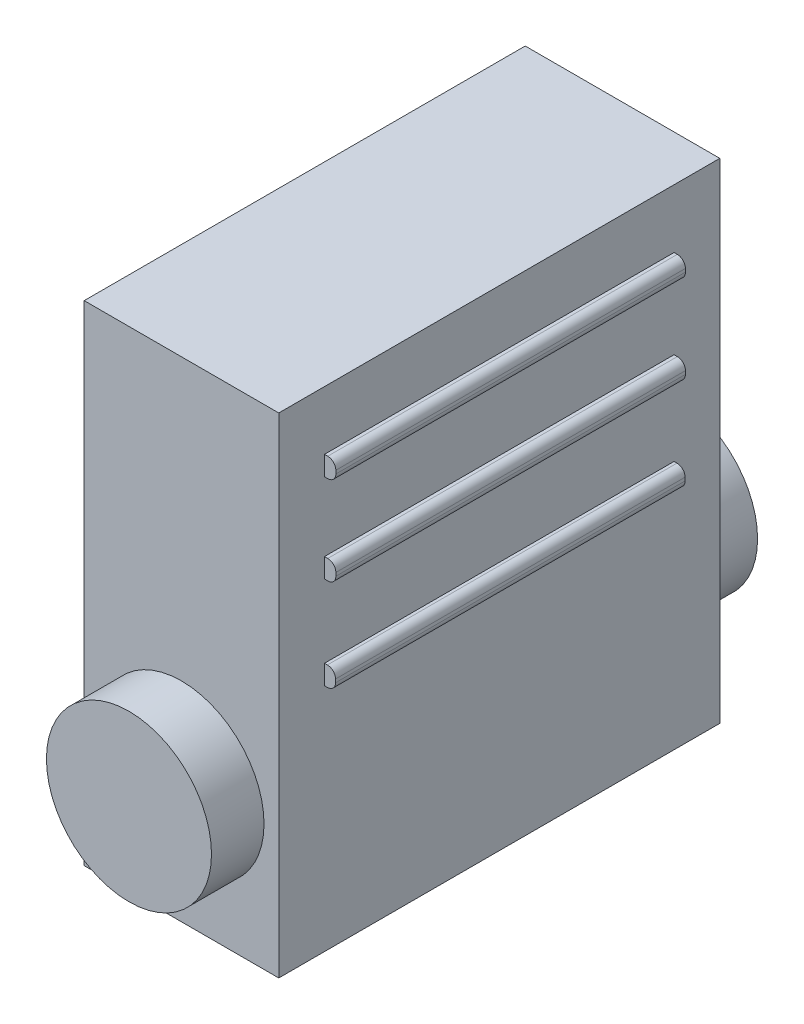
ISO-10303-21;
HEADER;
FILE_DESCRIPTION(('STEP AP214'),'2;1');
FILE_NAME('part.step','',(''),(''),'','','');
FILE_SCHEMA(('AUTOMOTIVE_DESIGN { 1 0 10303 214 1 1 1 1 }'));
ENDSEC;
DATA;
#1=APPLICATION_CONTEXT('core data for automotive mechanical design processes');
#2=APPLICATION_PROTOCOL_DEFINITION('international standard','automotive_design',2000,#1);
#3=PRODUCT_CONTEXT('',#1,'mechanical');
#4=PRODUCT('Part','Part','',(#3));
#5=PRODUCT_RELATED_PRODUCT_CATEGORY('part','',(#4));
#6=PRODUCT_DEFINITION_FORMATION('','',#4);
#7=PRODUCT_DEFINITION_CONTEXT('part definition',#1,'design');
#8=PRODUCT_DEFINITION('design','',#6,#7);
#9=PRODUCT_DEFINITION_SHAPE('','',#8);
#10=(LENGTH_UNIT() NAMED_UNIT(*) SI_UNIT(.MILLI.,.METRE.));
#11=(NAMED_UNIT(*) PLANE_ANGLE_UNIT() SI_UNIT($,.RADIAN.));
#12=(NAMED_UNIT(*) SI_UNIT($,.STERADIAN.) SOLID_ANGLE_UNIT());
#13=UNCERTAINTY_MEASURE_WITH_UNIT(LENGTH_MEASURE(1.E-05),#10,'distance_accuracy_value','');
#14=(GEOMETRIC_REPRESENTATION_CONTEXT(3) GLOBAL_UNCERTAINTY_ASSIGNED_CONTEXT((#13)) GLOBAL_UNIT_ASSIGNED_CONTEXT((#10,
#11,#12)) REPRESENTATION_CONTEXT('',''));
#15=CARTESIAN_POINT('',(0.,0.,0.));
#16=DIRECTION('',(0.,0.,1.));
#17=DIRECTION('',(1.,0.,0.));
#18=AXIS2_PLACEMENT_3D('',#15,#16,#17);
#19=CARTESIAN_POINT('',(-7.62,19.1643,34.544));
#20=DIRECTION('',(1.,0.,0.));
#21=DIRECTION('',(0.,1.,0.));
#22=AXIS2_PLACEMENT_3D('',#19,#20,#21);
#23=PLANE('',#22);
#24=DIRECTION('',(0.,1.,0.));
#25=VECTOR('',#24,1.);
#26=CARTESIAN_POINT('',(-7.62,0.39370000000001,30.9626));
#27=LINE('',#26,#25);
#28=CARTESIAN_POINT('',(-7.62,-1.13029999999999,30.9626));
#29=VERTEX_POINT('',#28);
#30=CARTESIAN_POINT('',(-7.62,0.393700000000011,30.9626));
#31=VERTEX_POINT('',#30);
#32=EDGE_CURVE('E286',#29,#31,#27,.T.);
#33=ORIENTED_EDGE('',*,*,#32,.F.);
#34=DIRECTION('',(0.,0.,1.));
#35=VECTOR('',#34,1.);
#36=CARTESIAN_POINT('',(-7.62,-1.13029999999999,3.5814));
#37=LINE('',#36,#35);
#38=CARTESIAN_POINT('',(-7.62,-1.13029999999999,3.5814));
#39=VERTEX_POINT('',#38);
#40=EDGE_CURVE('E291',#39,#29,#37,.T.);
#41=ORIENTED_EDGE('',*,*,#40,.F.);
#42=DIRECTION('',(0.,-1.,0.));
#43=VECTOR('',#42,1.);
#44=CARTESIAN_POINT('',(-7.62,0.39370000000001,3.5814));
#45=LINE('',#44,#43);
#46=CARTESIAN_POINT('',(-7.62,0.393700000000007,3.5814));
#47=VERTEX_POINT('',#46);
#48=EDGE_CURVE('E300',#47,#39,#45,.T.);
#49=ORIENTED_EDGE('',*,*,#48,.F.);
#50=DIRECTION('',(0.,0.,-1.));
#51=VECTOR('',#50,1.);
#52=CARTESIAN_POINT('',(-7.62,0.39370000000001,3.5814));
#53=LINE('',#52,#51);
#54=EDGE_CURVE('E297',#31,#47,#53,.T.);
#55=ORIENTED_EDGE('',*,*,#54,.F.);
#56=EDGE_LOOP('',(#33,#41,#49,#55));
#57=FACE_BOUND('',#56,.T.);
#58=DIRECTION('',(0.,-1.,0.));
#59=VECTOR('',#58,1.);
#60=CARTESIAN_POINT('',(-7.62,19.1643,0.));
#61=LINE('',#60,#59);
#62=CARTESIAN_POINT('',(-7.62,19.1643,0.));
#63=VERTEX_POINT('',#62);
#64=CARTESIAN_POINT('',(-7.62,-19.1643,0.));
#65=VERTEX_POINT('',#64);
#66=EDGE_CURVE('E414',#63,#65,#61,.T.);
#67=ORIENTED_EDGE('',*,*,#66,.T.);
#68=DIRECTION('',(0.,0.,-1.));
#69=VECTOR('',#68,1.);
#70=CARTESIAN_POINT('',(-7.62,-19.1643,34.544));
#71=LINE('',#70,#69);
#72=CARTESIAN_POINT('',(-7.62,-19.1643,34.544));
#73=VERTEX_POINT('',#72);
#74=EDGE_CURVE('E419',#73,#65,#71,.T.);
#75=ORIENTED_EDGE('',*,*,#74,.F.);
#76=DIRECTION('',(0.,-1.,0.));
#77=VECTOR('',#76,1.);
#78=CARTESIAN_POINT('',(-7.62,19.1643,34.544));
#79=LINE('',#78,#77);
#80=CARTESIAN_POINT('',(-7.62,19.1643,34.544));
#81=VERTEX_POINT('',#80);
#82=EDGE_CURVE('E405',#81,#73,#79,.T.);
#83=ORIENTED_EDGE('',*,*,#82,.F.);
#84=DIRECTION('',(0.,0.,-1.));
#85=VECTOR('',#84,1.);
#86=CARTESIAN_POINT('',(-7.62,19.1643,34.544));
#87=LINE('',#86,#85);
#88=EDGE_CURVE('E422',#81,#63,#87,.T.);
#89=ORIENTED_EDGE('',*,*,#88,.T.);
#90=EDGE_LOOP('',(#67,#75,#83,#89));
#91=FACE_BOUND('',#90,.T.);
#92=DIRECTION('',(0.,1.,0.));
#93=VECTOR('',#92,1.);
#94=CARTESIAN_POINT('',(-7.62,14.1097,30.9626));
#95=LINE('',#94,#93);
#96=CARTESIAN_POINT('',(-7.62,12.5857,30.9626));
#97=VERTEX_POINT('',#96);
#98=CARTESIAN_POINT('',(-7.62,14.1097,30.9626));
#99=VERTEX_POINT('',#98);
#100=EDGE_CURVE('E257',#97,#99,#95,.T.);
#101=ORIENTED_EDGE('',*,*,#100,.F.);
#102=DIRECTION('',(0.,0.,1.));
#103=VECTOR('',#102,1.);
#104=CARTESIAN_POINT('',(-7.62,12.5857,3.5814));
#105=LINE('',#104,#103);
#106=CARTESIAN_POINT('',(-7.62,12.5857,3.5814));
#107=VERTEX_POINT('',#106);
#108=EDGE_CURVE('E267',#107,#97,#105,.T.);
#109=ORIENTED_EDGE('',*,*,#108,.F.);
#110=DIRECTION('',(0.,-1.,0.));
#111=VECTOR('',#110,1.);
#112=CARTESIAN_POINT('',(-7.62,14.1097,3.5814));
#113=LINE('',#112,#111);
#114=CARTESIAN_POINT('',(-7.62,14.1097,3.5814));
#115=VERTEX_POINT('',#114);
#116=EDGE_CURVE('E274',#115,#107,#113,.T.);
#117=ORIENTED_EDGE('',*,*,#116,.F.);
#118=DIRECTION('',(0.,0.,-1.));
#119=VECTOR('',#118,1.);
#120=CARTESIAN_POINT('',(-7.62,14.1097,3.5814));
#121=LINE('',#120,#119);
#122=EDGE_CURVE('E270',#99,#115,#121,.T.);
#123=ORIENTED_EDGE('',*,*,#122,.F.);
#124=EDGE_LOOP('',(#101,#109,#117,#123));
#125=FACE_BOUND('',#124,.T.);
#126=ADVANCED_FACE('F32',(#57,#91,#125),#23,.F.);
#127=CARTESIAN_POINT('',(7.61999999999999,19.1643,34.544));
#128=DIRECTION('',(-1.,0.,0.));
#129=DIRECTION('',(0.,-1.,0.));
#130=AXIS2_PLACEMENT_3D('',#127,#128,#129);
#131=PLANE('',#130);
#132=DIRECTION('',(0.,1.,0.));
#133=VECTOR('',#132,1.);
#134=CARTESIAN_POINT('',(7.62,7.63270000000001,3.58139999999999));
#135=LINE('',#134,#133);
#136=CARTESIAN_POINT('',(7.62,6.10870000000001,3.58139999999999));
#137=VERTEX_POINT('',#136);
#138=CARTESIAN_POINT('',(7.62,7.63270000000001,3.58139999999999));
#139=VERTEX_POINT('',#138);
#140=EDGE_CURVE('E338',#137,#139,#135,.T.);
#141=ORIENTED_EDGE('',*,*,#140,.F.);
#142=DIRECTION('',(0.,0.,-1.));
#143=VECTOR('',#142,1.);
#144=CARTESIAN_POINT('',(7.62,6.10870000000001,30.9626));
#145=LINE('',#144,#143);
#146=CARTESIAN_POINT('',(7.62,6.10870000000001,30.9626));
#147=VERTEX_POINT('',#146);
#148=EDGE_CURVE('E343',#147,#137,#145,.T.);
#149=ORIENTED_EDGE('',*,*,#148,.F.);
#150=DIRECTION('',(0.,-1.,0.));
#151=VECTOR('',#150,1.);
#152=CARTESIAN_POINT('',(7.62,7.63270000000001,30.9626));
#153=LINE('',#152,#151);
#154=CARTESIAN_POINT('',(7.62,7.63270000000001,30.9626));
#155=VERTEX_POINT('',#154);
#156=EDGE_CURVE('E352',#155,#147,#153,.T.);
#157=ORIENTED_EDGE('',*,*,#156,.F.);
#158=DIRECTION('',(0.,0.,1.));
#159=VECTOR('',#158,1.);
#160=CARTESIAN_POINT('',(7.62,7.63270000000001,30.9626));
#161=LINE('',#160,#159);
#162=EDGE_CURVE('E349',#139,#155,#161,.T.);
#163=ORIENTED_EDGE('',*,*,#162,.F.);
#164=EDGE_LOOP('',(#141,#149,#157,#163));
#165=FACE_BOUND('',#164,.T.);
#166=DIRECTION('',(0.,1.,0.));
#167=VECTOR('',#166,1.);
#168=CARTESIAN_POINT('',(7.61999999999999,19.1643,0.));
#169=LINE('',#168,#167);
#170=CARTESIAN_POINT('',(7.62,-19.1643,0.));
#171=VERTEX_POINT('',#170);
#172=CARTESIAN_POINT('',(7.61999999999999,19.1643,0.));
#173=VERTEX_POINT('',#172);
#174=EDGE_CURVE('E398',#171,#173,#169,.T.);
#175=ORIENTED_EDGE('',*,*,#174,.T.);
#176=DIRECTION('',(0.,0.,-1.));
#177=VECTOR('',#176,1.);
#178=CARTESIAN_POINT('',(7.61999999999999,19.1643,34.544));
#179=LINE('',#178,#177);
#180=CARTESIAN_POINT('',(7.61999999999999,19.1643,34.544));
#181=VERTEX_POINT('',#180);
#182=EDGE_CURVE('E425',#181,#173,#179,.T.);
#183=ORIENTED_EDGE('',*,*,#182,.F.);
#184=DIRECTION('',(0.,1.,0.));
#185=VECTOR('',#184,1.);
#186=CARTESIAN_POINT('',(7.61999999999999,19.1643,34.544));
#187=LINE('',#186,#185);
#188=CARTESIAN_POINT('',(7.62,-19.1643,34.544));
#189=VERTEX_POINT('',#188);
#190=EDGE_CURVE('E399',#189,#181,#187,.T.);
#191=ORIENTED_EDGE('',*,*,#190,.F.);
#192=DIRECTION('',(0.,0.,-1.));
#193=VECTOR('',#192,1.);
#194=CARTESIAN_POINT('',(7.62,-19.1643,34.544));
#195=LINE('',#194,#193);
#196=EDGE_CURVE('E409',#189,#171,#195,.T.);
#197=ORIENTED_EDGE('',*,*,#196,.T.);
#198=EDGE_LOOP('',(#175,#183,#191,#197));
#199=FACE_BOUND('',#198,.T.);
#200=DIRECTION('',(0.,1.,0.));
#201=VECTOR('',#200,1.);
#202=CARTESIAN_POINT('',(7.62,0.393700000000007,3.5814));
#203=LINE('',#202,#201);
#204=CARTESIAN_POINT('',(7.62,-1.13029999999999,3.5814));
#205=VERTEX_POINT('',#204);
#206=CARTESIAN_POINT('',(7.62,0.393700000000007,3.5814));
#207=VERTEX_POINT('',#206);
#208=EDGE_CURVE('E364',#205,#207,#203,.T.);
#209=ORIENTED_EDGE('',*,*,#208,.F.);
#210=DIRECTION('',(0.,0.,-1.));
#211=VECTOR('',#210,1.);
#212=CARTESIAN_POINT('',(7.62,-1.13029999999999,30.9626));
#213=LINE('',#212,#211);
#214=CARTESIAN_POINT('',(7.62,-1.13029999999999,30.9626));
#215=VERTEX_POINT('',#214);
#216=EDGE_CURVE('E368',#215,#205,#213,.T.);
#217=ORIENTED_EDGE('',*,*,#216,.F.);
#218=DIRECTION('',(0.,-1.,0.));
#219=VECTOR('',#218,1.);
#220=CARTESIAN_POINT('',(7.62,0.393700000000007,30.9626));
#221=LINE('',#220,#219);
#222=CARTESIAN_POINT('',(7.62,0.393700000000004,30.9626));
#223=VERTEX_POINT('',#222);
#224=EDGE_CURVE('E377',#223,#215,#221,.T.);
#225=ORIENTED_EDGE('',*,*,#224,.F.);
#226=DIRECTION('',(0.,0.,1.));
#227=VECTOR('',#226,1.);
#228=CARTESIAN_POINT('',(7.62,0.393700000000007,30.9626));
#229=LINE('',#228,#227);
#230=EDGE_CURVE('E374',#207,#223,#229,.T.);
#231=ORIENTED_EDGE('',*,*,#230,.F.);
#232=EDGE_LOOP('',(#209,#217,#225,#231));
#233=FACE_BOUND('',#232,.T.);
#234=DIRECTION('',(0.,1.,0.));
#235=VECTOR('',#234,1.);
#236=CARTESIAN_POINT('',(7.61999999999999,14.5669,3.5814));
#237=LINE('',#236,#235);
#238=CARTESIAN_POINT('',(7.62,13.0429,3.5814));
#239=VERTEX_POINT('',#238);
#240=CARTESIAN_POINT('',(7.61999999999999,14.5669,3.5814));
#241=VERTEX_POINT('',#240);
#242=EDGE_CURVE('E312',#239,#241,#237,.T.);
#243=ORIENTED_EDGE('',*,*,#242,.F.);
#244=DIRECTION('',(0.,0.,-1.));
#245=VECTOR('',#244,1.);
#246=CARTESIAN_POINT('',(7.62,13.0429,30.9626));
#247=LINE('',#246,#245);
#248=CARTESIAN_POINT('',(7.62,13.0429,30.9626));
#249=VERTEX_POINT('',#248);
#250=EDGE_CURVE('E317',#249,#239,#247,.T.);
#251=ORIENTED_EDGE('',*,*,#250,.F.);
#252=DIRECTION('',(0.,-1.,0.));
#253=VECTOR('',#252,1.);
#254=CARTESIAN_POINT('',(7.61999999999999,14.5669,30.9626));
#255=LINE('',#254,#253);
#256=CARTESIAN_POINT('',(7.61999999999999,14.5669,30.9626));
#257=VERTEX_POINT('',#256);
#258=EDGE_CURVE('E326',#257,#249,#255,.T.);
#259=ORIENTED_EDGE('',*,*,#258,.F.);
#260=DIRECTION('',(0.,0.,1.));
#261=VECTOR('',#260,1.);
#262=CARTESIAN_POINT('',(7.61999999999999,14.5669,30.9626));
#263=LINE('',#262,#261);
#264=EDGE_CURVE('E323',#241,#257,#263,.T.);
#265=ORIENTED_EDGE('',*,*,#264,.F.);
#266=EDGE_LOOP('',(#243,#251,#259,#265));
#267=FACE_BOUND('',#266,.T.);
#268=ADVANCED_FACE('F533',(#165,#199,#233,#267),#131,.F.);
#269=CARTESIAN_POINT('',(-7.62,19.1643,34.544));
#270=DIRECTION('',(0.,-1.,0.));
#271=DIRECTION('',(0.,0.,-1.));
#272=AXIS2_PLACEMENT_3D('',#269,#270,#271);
#273=PLANE('',#272);
#274=DIRECTION('',(-1.,0.,0.));
#275=VECTOR('',#274,1.);
#276=CARTESIAN_POINT('',(-7.62,19.1643,0.));
#277=LINE('',#276,#275);
#278=EDGE_CURVE('E412',#173,#63,#277,.T.);
#279=ORIENTED_EDGE('',*,*,#278,.T.);
#280=ORIENTED_EDGE('',*,*,#88,.F.);
#281=DIRECTION('',(-1.,0.,0.));
#282=VECTOR('',#281,1.);
#283=CARTESIAN_POINT('',(-7.62,19.1643,34.544));
#284=LINE('',#283,#282);
#285=EDGE_CURVE('E402',#181,#81,#284,.T.);
#286=ORIENTED_EDGE('',*,*,#285,.F.);
#287=ORIENTED_EDGE('',*,*,#182,.T.);
#288=EDGE_LOOP('',(#279,#280,#286,#287));
#289=FACE_BOUND('',#288,.T.);
#290=ADVANCED_FACE('F539',(#289),#273,.F.);
#291=CARTESIAN_POINT('',(-7.62,-19.1643,34.544));
#292=DIRECTION('',(0.,1.,0.));
#293=DIRECTION('',(0.,0.,1.));
#294=AXIS2_PLACEMENT_3D('',#291,#292,#293);
#295=PLANE('',#294);
#296=DIRECTION('',(1.,0.,0.));
#297=VECTOR('',#296,1.);
#298=CARTESIAN_POINT('',(-7.62,-19.1643,0.));
#299=LINE('',#298,#297);
#300=EDGE_CURVE('E403',#65,#171,#299,.T.);
#301=ORIENTED_EDGE('',*,*,#300,.T.);
#302=ORIENTED_EDGE('',*,*,#196,.F.);
#303=DIRECTION('',(1.,0.,0.));
#304=VECTOR('',#303,1.);
#305=CARTESIAN_POINT('',(-7.62,-19.1643,34.544));
#306=LINE('',#305,#304);
#307=EDGE_CURVE('E407',#73,#189,#306,.T.);
#308=ORIENTED_EDGE('',*,*,#307,.F.);
#309=ORIENTED_EDGE('',*,*,#74,.T.);
#310=EDGE_LOOP('',(#301,#302,#308,#309));
#311=FACE_BOUND('',#310,.T.);
#312=ADVANCED_FACE('F546',(#311),#295,.F.);
#313=CARTESIAN_POINT('',(0.,0.,34.544));
#314=DIRECTION('',(0.,0.,1.));
#315=DIRECTION('',(1.,0.,0.));
#316=AXIS2_PLACEMENT_3D('',#313,#314,#315);
#317=PLANE('',#316);
#318=CARTESIAN_POINT('',(0.,-9.2837,34.544));
#319=DIRECTION('',(0.,0.,1.));
#320=DIRECTION('',(1.,0.,0.));
#321=AXIS2_PLACEMENT_3D('',#318,#319,#320);
#322=CIRCLE('',#321,6.4643);
#323=CARTESIAN_POINT('',(6.4643,-9.2837,34.544));
#324=VERTEX_POINT('',#323);
#325=EDGE_CURVE('E389',#324,#324,#322,.T.);
#326=ORIENTED_EDGE('',*,*,#325,.F.);
#327=EDGE_LOOP('',(#326));
#328=FACE_BOUND('',#327,.T.);
#329=ORIENTED_EDGE('',*,*,#190,.T.);
#330=ORIENTED_EDGE('',*,*,#285,.T.);
#331=ORIENTED_EDGE('',*,*,#82,.T.);
#332=ORIENTED_EDGE('',*,*,#307,.T.);
#333=EDGE_LOOP('',(#329,#330,#331,#332));
#334=FACE_BOUND('',#333,.T.);
#335=ADVANCED_FACE('F701',(#328,#334),#317,.T.);
#336=CARTESIAN_POINT('',(0.,0.,0.));
#337=DIRECTION('',(0.,0.,1.));
#338=DIRECTION('',(1.,0.,0.));
#339=AXIS2_PLACEMENT_3D('',#336,#337,#338);
#340=PLANE('',#339);
#341=CARTESIAN_POINT('',(0.,-9.2837,0.));
#342=DIRECTION('',(0.,0.,1.));
#343=DIRECTION('',(1.,0.,0.));
#344=AXIS2_PLACEMENT_3D('',#341,#342,#343);
#345=CIRCLE('',#344,6.4643);
#346=CARTESIAN_POINT('',(6.4643,-9.2837,0.));
#347=VERTEX_POINT('',#346);
#348=EDGE_CURVE('E428',#347,#347,#345,.F.);
#349=ORIENTED_EDGE('',*,*,#348,.F.);
#350=EDGE_LOOP('',(#349));
#351=FACE_BOUND('',#350,.T.);
#352=ORIENTED_EDGE('',*,*,#174,.F.);
#353=ORIENTED_EDGE('',*,*,#300,.F.);
#354=ORIENTED_EDGE('',*,*,#66,.F.);
#355=ORIENTED_EDGE('',*,*,#278,.F.);
#356=EDGE_LOOP('',(#352,#353,#354,#355));
#357=FACE_BOUND('',#356,.T.);
#358=ADVANCED_FACE('F699',(#351,#357),#340,.F.);
#359=CARTESIAN_POINT('',(0.,-9.2837,-4.1148));
#360=DIRECTION('',(0.,0.,1.));
#361=DIRECTION('',(1.,0.,0.));
#362=AXIS2_PLACEMENT_3D('',#359,#360,#361);
#363=CYLINDRICAL_SURFACE('',#362,6.4643);
#364=CARTESIAN_POINT('',(0.,-9.2837,-4.1148));
#365=DIRECTION('',(0.,0.,-1.));
#366=DIRECTION('',(-1.,0.,0.));
#367=AXIS2_PLACEMENT_3D('',#364,#365,#366);
#368=CIRCLE('',#367,6.4643);
#369=CARTESIAN_POINT('',(-6.4643,-9.2837,-4.1148));
#370=VERTEX_POINT('',#369);
#371=EDGE_CURVE('E393',#370,#370,#368,.T.);
#372=ORIENTED_EDGE('',*,*,#371,.F.);
#373=EDGE_LOOP('',(#372));
#374=FACE_BOUND('',#373,.T.);
#375=ORIENTED_EDGE('',*,*,#348,.T.);
#376=EDGE_LOOP('',(#375));
#377=FACE_BOUND('',#376,.T.);
#378=ADVANCED_FACE('F695',(#374,#377),#363,.T.);
#379=CARTESIAN_POINT('',(0.,-9.2837,-4.1148));
#380=DIRECTION('',(0.,0.,-1.));
#381=DIRECTION('',(-1.,0.,0.));
#382=AXIS2_PLACEMENT_3D('',#379,#380,#381);
#383=PLANE('',#382);
#384=ORIENTED_EDGE('',*,*,#371,.T.);
#385=EDGE_LOOP('',(#384));
#386=FACE_BOUND('',#385,.T.);
#387=ADVANCED_FACE('F691',(#386),#383,.T.);
#388=CARTESIAN_POINT('',(0.,-9.2837,38.6588));
#389=DIRECTION('',(0.,0.,-1.));
#390=DIRECTION('',(-1.,0.,0.));
#391=AXIS2_PLACEMENT_3D('',#388,#389,#390);
#392=CYLINDRICAL_SURFACE('',#391,6.4643);
#393=CARTESIAN_POINT('',(0.,-9.2837,38.6588));
#394=DIRECTION('',(0.,0.,1.));
#395=DIRECTION('',(1.,0.,0.));
#396=AXIS2_PLACEMENT_3D('',#393,#394,#395);
#397=CIRCLE('',#396,6.4643);
#398=CARTESIAN_POINT('',(6.4643,-9.2837,38.6588));
#399=VERTEX_POINT('',#398);
#400=EDGE_CURVE('E390',#399,#399,#397,.T.);
#401=ORIENTED_EDGE('',*,*,#400,.F.);
#402=EDGE_LOOP('',(#401));
#403=FACE_BOUND('',#402,.T.);
#404=ORIENTED_EDGE('',*,*,#325,.T.);
#405=EDGE_LOOP('',(#404));
#406=FACE_BOUND('',#405,.T.);
#407=ADVANCED_FACE('F687',(#403,#406),#392,.T.);
#408=CARTESIAN_POINT('',(0.,-9.2837,38.6588));
#409=DIRECTION('',(0.,0.,1.));
#410=DIRECTION('',(1.,0.,0.));
#411=AXIS2_PLACEMENT_3D('',#408,#409,#410);
#412=PLANE('',#411);
#413=ORIENTED_EDGE('',*,*,#400,.T.);
#414=EDGE_LOOP('',(#413));
#415=FACE_BOUND('',#414,.T.);
#416=ADVANCED_FACE('F683',(#415),#412,.T.);
#417=CARTESIAN_POINT('',(8.4836,0.393700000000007,3.5814));
#418=DIRECTION('',(0.,0.,1.));
#419=DIRECTION('',(1.,0.,0.));
#420=AXIS2_PLACEMENT_3D('',#417,#418,#419);
#421=PLANE('',#420);
#422=DIRECTION('',(0.,1.,0.));
#423=VECTOR('',#422,1.);
#424=CARTESIAN_POINT('',(8.4836,0.393700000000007,3.5814));
#425=LINE('',#424,#423);
#426=CARTESIAN_POINT('',(8.4836,-0.495299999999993,3.5814));
#427=VERTEX_POINT('',#426);
#428=CARTESIAN_POINT('',(8.4836,-0.241299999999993,3.5814));
#429=VERTEX_POINT('',#428);
#430=EDGE_CURVE('E365',#427,#429,#425,.T.);
#431=ORIENTED_EDGE('',*,*,#430,.F.);
#432=CARTESIAN_POINT('',(7.8486,-0.495299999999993,3.5814));
#433=DIRECTION('',(0.,0.,1.));
#434=DIRECTION('',(1.,0.,0.));
#435=AXIS2_PLACEMENT_3D('',#432,#433,#434);
#436=CIRCLE('',#435,0.635);
#437=CARTESIAN_POINT('',(7.8486,-1.13029999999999,3.5814));
#438=VERTEX_POINT('',#437);
#439=EDGE_CURVE('E444',#427,#438,#436,.F.);
#440=ORIENTED_EDGE('',*,*,#439,.T.);
#441=DIRECTION('',(-1.,0.,0.));
#442=VECTOR('',#441,1.);
#443=CARTESIAN_POINT('',(8.4836,-1.13029999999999,3.5814));
#444=LINE('',#443,#442);
#445=EDGE_CURVE('E371',#438,#205,#444,.T.);
#446=ORIENTED_EDGE('',*,*,#445,.T.);
#447=ORIENTED_EDGE('',*,*,#208,.T.);
#448=DIRECTION('',(-1.,0.,0.));
#449=VECTOR('',#448,1.);
#450=CARTESIAN_POINT('',(8.4836,0.393700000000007,3.5814));
#451=LINE('',#450,#449);
#452=CARTESIAN_POINT('',(7.8486,0.393700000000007,3.5814));
#453=VERTEX_POINT('',#452);
#454=EDGE_CURVE('E387',#453,#207,#451,.T.);
#455=ORIENTED_EDGE('',*,*,#454,.F.);
#456=CARTESIAN_POINT('',(7.8486,-0.241299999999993,3.5814));
#457=DIRECTION('',(0.,0.,1.));
#458=DIRECTION('',(1.,0.,0.));
#459=AXIS2_PLACEMENT_3D('',#456,#457,#458);
#460=CIRCLE('',#459,0.635);
#461=EDGE_CURVE('E438',#453,#429,#460,.F.);
#462=ORIENTED_EDGE('',*,*,#461,.T.);
#463=EDGE_LOOP('',(#431,#440,#446,#447,#455,#462));
#464=FACE_BOUND('',#463,.T.);
#465=ADVANCED_FACE('F679',(#464),#421,.F.);
#466=CARTESIAN_POINT('',(8.4836,0.393700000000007,30.9626));
#467=DIRECTION('',(0.,-1.,0.));
#468=DIRECTION('',(1.,0.,0.));
#469=AXIS2_PLACEMENT_3D('',#466,#467,#468);
#470=PLANE('',#469);
#471=DIRECTION('',(-1.,0.,0.));
#472=VECTOR('',#471,1.);
#473=CARTESIAN_POINT('',(8.4836,0.393700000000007,30.9626));
#474=LINE('',#473,#472);
#475=CARTESIAN_POINT('',(7.8486,0.393700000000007,30.9626));
#476=VERTEX_POINT('',#475);
#477=EDGE_CURVE('E385',#476,#223,#474,.T.);
#478=ORIENTED_EDGE('',*,*,#477,.F.);
#479=DIRECTION('',(0.,0.,1.));
#480=VECTOR('',#479,1.);
#481=CARTESIAN_POINT('',(7.8486,0.393700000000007,3.5814));
#482=LINE('',#481,#480);
#483=EDGE_CURVE('E436',#476,#453,#482,.F.);
#484=ORIENTED_EDGE('',*,*,#483,.T.);
#485=ORIENTED_EDGE('',*,*,#454,.T.);
#486=ORIENTED_EDGE('',*,*,#230,.T.);
#487=EDGE_LOOP('',(#478,#484,#485,#486));
#488=FACE_BOUND('',#487,.T.);
#489=ADVANCED_FACE('F675',(#488),#470,.F.);
#490=CARTESIAN_POINT('',(8.4836,0.393700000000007,30.9626));
#491=DIRECTION('',(0.,0.,-1.));
#492=DIRECTION('',(-1.,0.,0.));
#493=AXIS2_PLACEMENT_3D('',#490,#491,#492);
#494=PLANE('',#493);
#495=DIRECTION('',(-1.,0.,0.));
#496=VECTOR('',#495,1.);
#497=CARTESIAN_POINT('',(8.4836,-1.13029999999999,30.9626));
#498=LINE('',#497,#496);
#499=CARTESIAN_POINT('',(7.8486,-1.13029999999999,30.9626));
#500=VERTEX_POINT('',#499);
#501=EDGE_CURVE('E383',#500,#215,#498,.T.);
#502=ORIENTED_EDGE('',*,*,#501,.F.);
#503=CARTESIAN_POINT('',(7.8486,-0.495299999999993,30.9626));
#504=DIRECTION('',(0.,0.,-1.));
#505=DIRECTION('',(-1.,0.,0.));
#506=AXIS2_PLACEMENT_3D('',#503,#504,#505);
#507=CIRCLE('',#506,0.635);
#508=CARTESIAN_POINT('',(8.4836,-0.495299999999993,30.9626));
#509=VERTEX_POINT('',#508);
#510=EDGE_CURVE('E448',#500,#509,#507,.F.);
#511=ORIENTED_EDGE('',*,*,#510,.T.);
#512=DIRECTION('',(0.,-1.,0.));
#513=VECTOR('',#512,1.);
#514=CARTESIAN_POINT('',(8.4836,0.393700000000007,30.9626));
#515=LINE('',#514,#513);
#516=CARTESIAN_POINT('',(8.4836,-0.241299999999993,30.9626));
#517=VERTEX_POINT('',#516);
#518=EDGE_CURVE('E367',#517,#509,#515,.T.);
#519=ORIENTED_EDGE('',*,*,#518,.F.);
#520=CARTESIAN_POINT('',(7.8486,-0.241299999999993,30.9626));
#521=DIRECTION('',(0.,0.,-1.));
#522=DIRECTION('',(-1.,0.,0.));
#523=AXIS2_PLACEMENT_3D('',#520,#521,#522);
#524=CIRCLE('',#523,0.635);
#525=EDGE_CURVE('E434',#517,#476,#524,.F.);
#526=ORIENTED_EDGE('',*,*,#525,.T.);
#527=ORIENTED_EDGE('',*,*,#477,.T.);
#528=ORIENTED_EDGE('',*,*,#224,.T.);
#529=EDGE_LOOP('',(#502,#511,#519,#526,#527,#528));
#530=FACE_BOUND('',#529,.T.);
#531=ADVANCED_FACE('F671',(#530),#494,.F.);
#532=CARTESIAN_POINT('',(8.4836,-1.13029999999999,30.9626));
#533=DIRECTION('',(0.,1.,0.));
#534=DIRECTION('',(-1.,0.,0.));
#535=AXIS2_PLACEMENT_3D('',#532,#533,#534);
#536=PLANE('',#535);
#537=ORIENTED_EDGE('',*,*,#445,.F.);
#538=DIRECTION('',(0.,0.,-1.));
#539=VECTOR('',#538,1.);
#540=CARTESIAN_POINT('',(7.8486,-1.13029999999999,30.9626));
#541=LINE('',#540,#539);
#542=EDGE_CURVE('E446',#438,#500,#541,.F.);
#543=ORIENTED_EDGE('',*,*,#542,.T.);
#544=ORIENTED_EDGE('',*,*,#501,.T.);
#545=ORIENTED_EDGE('',*,*,#216,.T.);
#546=EDGE_LOOP('',(#537,#543,#544,#545));
#547=FACE_BOUND('',#546,.T.);
#548=ADVANCED_FACE('F667',(#547),#536,.F.);
#549=CARTESIAN_POINT('',(8.4836,0.,0.));
#550=DIRECTION('',(1.,0.,0.));
#551=DIRECTION('',(0.,0.,-1.));
#552=AXIS2_PLACEMENT_3D('',#549,#550,#551);
#553=PLANE('',#552);
#554=ORIENTED_EDGE('',*,*,#518,.T.);
#555=DIRECTION('',(0.,0.,-1.));
#556=VECTOR('',#555,1.);
#557=CARTESIAN_POINT('',(8.4836,-0.495299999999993,3.5814));
#558=LINE('',#557,#556);
#559=EDGE_CURVE('E441',#509,#427,#558,.T.);
#560=ORIENTED_EDGE('',*,*,#559,.T.);
#561=ORIENTED_EDGE('',*,*,#430,.T.);
#562=DIRECTION('',(0.,0.,1.));
#563=VECTOR('',#562,1.);
#564=CARTESIAN_POINT('',(8.4836,-0.241299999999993,30.9626));
#565=LINE('',#564,#563);
#566=EDGE_CURVE('E431',#429,#517,#565,.T.);
#567=ORIENTED_EDGE('',*,*,#566,.T.);
#568=EDGE_LOOP('',(#554,#560,#561,#567));
#569=FACE_BOUND('',#568,.T.);
#570=ADVANCED_FACE('F555',(#569),#553,.T.);
#571=CARTESIAN_POINT('',(7.8486,-0.241299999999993,0.));
#572=DIRECTION('',(0.,0.,-1.));
#573=DIRECTION('',(-1.,0.,0.));
#574=AXIS2_PLACEMENT_3D('',#571,#572,#573);
#575=CYLINDRICAL_SURFACE('',#574,0.635);
#576=ORIENTED_EDGE('',*,*,#461,.F.);
#577=ORIENTED_EDGE('',*,*,#483,.F.);
#578=ORIENTED_EDGE('',*,*,#525,.F.);
#579=ORIENTED_EDGE('',*,*,#566,.F.);
#580=EDGE_LOOP('',(#576,#577,#578,#579));
#581=FACE_BOUND('',#580,.T.);
#582=ADVANCED_FACE('F551',(#581),#575,.T.);
#583=CARTESIAN_POINT('',(7.8486,-0.495299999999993,0.));
#584=DIRECTION('',(0.,0.,1.));
#585=DIRECTION('',(1.,0.,0.));
#586=AXIS2_PLACEMENT_3D('',#583,#584,#585);
#587=CYLINDRICAL_SURFACE('',#586,0.635);
#588=ORIENTED_EDGE('',*,*,#510,.F.);
#589=ORIENTED_EDGE('',*,*,#542,.F.);
#590=ORIENTED_EDGE('',*,*,#439,.F.);
#591=ORIENTED_EDGE('',*,*,#559,.F.);
#592=EDGE_LOOP('',(#588,#589,#590,#591));
#593=FACE_BOUND('',#592,.T.);
#594=ADVANCED_FACE('F554',(#593),#587,.T.);
#595=CARTESIAN_POINT('',(8.509,7.63270000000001,3.58139999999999));
#596=DIRECTION('',(0.,0.,1.));
#597=DIRECTION('',(1.,0.,0.));
#598=AXIS2_PLACEMENT_3D('',#595,#596,#597);
#599=PLANE('',#598);
#600=DIRECTION('',(0.,1.,0.));
#601=VECTOR('',#600,1.);
#602=CARTESIAN_POINT('',(8.509,7.63270000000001,3.58139999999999));
#603=LINE('',#602,#601);
#604=CARTESIAN_POINT('',(8.509,6.74370000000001,3.58139999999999));
#605=VERTEX_POINT('',#604);
#606=CARTESIAN_POINT('',(8.509,6.99770000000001,3.58139999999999));
#607=VERTEX_POINT('',#606);
#608=EDGE_CURVE('E339',#605,#607,#603,.T.);
#609=ORIENTED_EDGE('',*,*,#608,.F.);
#610=CARTESIAN_POINT('',(7.874,6.74370000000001,3.58139999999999));
#611=DIRECTION('',(0.,0.,1.));
#612=DIRECTION('',(1.,0.,0.));
#613=AXIS2_PLACEMENT_3D('',#610,#611,#612);
#614=CIRCLE('',#613,0.635);
#615=CARTESIAN_POINT('',(7.874,6.10870000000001,3.58139999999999));
#616=VERTEX_POINT('',#615);
#617=EDGE_CURVE('E476',#605,#616,#614,.F.);
#618=ORIENTED_EDGE('',*,*,#617,.T.);
#619=DIRECTION('',(-1.,0.,0.));
#620=VECTOR('',#619,1.);
#621=CARTESIAN_POINT('',(8.509,6.10870000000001,3.58139999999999));
#622=LINE('',#621,#620);
#623=EDGE_CURVE('E346',#616,#137,#622,.T.);
#624=ORIENTED_EDGE('',*,*,#623,.T.);
#625=ORIENTED_EDGE('',*,*,#140,.T.);
#626=DIRECTION('',(-1.,0.,0.));
#627=VECTOR('',#626,1.);
#628=CARTESIAN_POINT('',(8.509,7.63270000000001,3.58139999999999));
#629=LINE('',#628,#627);
#630=CARTESIAN_POINT('',(7.874,7.63270000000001,3.58139999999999));
#631=VERTEX_POINT('',#630);
#632=EDGE_CURVE('E362',#631,#139,#629,.T.);
#633=ORIENTED_EDGE('',*,*,#632,.F.);
#634=CARTESIAN_POINT('',(7.874,6.99770000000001,3.58139999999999));
#635=DIRECTION('',(0.,0.,1.));
#636=DIRECTION('',(1.,0.,0.));
#637=AXIS2_PLACEMENT_3D('',#634,#635,#636);
#638=CIRCLE('',#637,0.635);
#639=EDGE_CURVE('E474',#631,#607,#638,.F.);
#640=ORIENTED_EDGE('',*,*,#639,.T.);
#641=EDGE_LOOP('',(#609,#618,#624,#625,#633,#640));
#642=FACE_BOUND('',#641,.T.);
#643=ADVANCED_FACE('F559',(#642),#599,.F.);
#644=CARTESIAN_POINT('',(8.509,7.63270000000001,30.9626));
#645=DIRECTION('',(0.,-1.,0.));
#646=DIRECTION('',(1.,0.,0.));
#647=AXIS2_PLACEMENT_3D('',#644,#645,#646);
#648=PLANE('',#647);
#649=DIRECTION('',(-1.,0.,0.));
#650=VECTOR('',#649,1.);
#651=CARTESIAN_POINT('',(8.509,7.63270000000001,30.9626));
#652=LINE('',#651,#650);
#653=CARTESIAN_POINT('',(7.874,7.63270000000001,30.9626));
#654=VERTEX_POINT('',#653);
#655=EDGE_CURVE('E360',#654,#155,#652,.T.);
#656=ORIENTED_EDGE('',*,*,#655,.F.);
#657=DIRECTION('',(0.,0.,1.));
#658=VECTOR('',#657,1.);
#659=CARTESIAN_POINT('',(7.874,7.63270000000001,3.58139999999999));
#660=LINE('',#659,#658);
#661=EDGE_CURVE('E484',#654,#631,#660,.F.);
#662=ORIENTED_EDGE('',*,*,#661,.T.);
#663=ORIENTED_EDGE('',*,*,#632,.T.);
#664=ORIENTED_EDGE('',*,*,#162,.T.);
#665=EDGE_LOOP('',(#656,#662,#663,#664));
#666=FACE_BOUND('',#665,.T.);
#667=ADVANCED_FACE('F657',(#666),#648,.F.);
#668=CARTESIAN_POINT('',(8.509,7.63270000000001,30.9626));
#669=DIRECTION('',(0.,0.,-1.));
#670=DIRECTION('',(-1.,0.,0.));
#671=AXIS2_PLACEMENT_3D('',#668,#669,#670);
#672=PLANE('',#671);
#673=DIRECTION('',(-1.,0.,0.));
#674=VECTOR('',#673,1.);
#675=CARTESIAN_POINT('',(8.509,6.10870000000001,30.9626));
#676=LINE('',#675,#674);
#677=CARTESIAN_POINT('',(7.874,6.10870000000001,30.9626));
#678=VERTEX_POINT('',#677);
#679=EDGE_CURVE('E358',#678,#147,#676,.T.);
#680=ORIENTED_EDGE('',*,*,#679,.F.);
#681=CARTESIAN_POINT('',(7.874,6.74370000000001,30.9626));
#682=DIRECTION('',(0.,0.,-1.));
#683=DIRECTION('',(-1.,0.,0.));
#684=AXIS2_PLACEMENT_3D('',#681,#682,#683);
#685=CIRCLE('',#684,0.635);
#686=CARTESIAN_POINT('',(8.509,6.74370000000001,30.9626));
#687=VERTEX_POINT('',#686);
#688=EDGE_CURVE('E482',#678,#687,#685,.F.);
#689=ORIENTED_EDGE('',*,*,#688,.T.);
#690=DIRECTION('',(0.,-1.,0.));
#691=VECTOR('',#690,1.);
#692=CARTESIAN_POINT('',(8.509,7.63270000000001,30.9626));
#693=LINE('',#692,#691);
#694=CARTESIAN_POINT('',(8.509,6.99770000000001,30.9626));
#695=VERTEX_POINT('',#694);
#696=EDGE_CURVE('E342',#695,#687,#693,.T.);
#697=ORIENTED_EDGE('',*,*,#696,.F.);
#698=CARTESIAN_POINT('',(7.874,6.99770000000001,30.9626));
#699=DIRECTION('',(0.,0.,-1.));
#700=DIRECTION('',(-1.,0.,0.));
#701=AXIS2_PLACEMENT_3D('',#698,#699,#700);
#702=CIRCLE('',#701,0.635);
#703=EDGE_CURVE('E480',#695,#654,#702,.F.);
#704=ORIENTED_EDGE('',*,*,#703,.T.);
#705=ORIENTED_EDGE('',*,*,#655,.T.);
#706=ORIENTED_EDGE('',*,*,#156,.T.);
#707=EDGE_LOOP('',(#680,#689,#697,#704,#705,#706));
#708=FACE_BOUND('',#707,.T.);
#709=ADVANCED_FACE('F653',(#708),#672,.F.);
#710=CARTESIAN_POINT('',(8.509,6.10870000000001,30.9626));
#711=DIRECTION('',(0.,1.,0.));
#712=DIRECTION('',(-1.,0.,0.));
#713=AXIS2_PLACEMENT_3D('',#710,#711,#712);
#714=PLANE('',#713);
#715=ORIENTED_EDGE('',*,*,#623,.F.);
#716=DIRECTION('',(0.,0.,-1.));
#717=VECTOR('',#716,1.);
#718=CARTESIAN_POINT('',(7.874,6.10870000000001,30.9626));
#719=LINE('',#718,#717);
#720=EDGE_CURVE('E478',#616,#678,#719,.F.);
#721=ORIENTED_EDGE('',*,*,#720,.T.);
#722=ORIENTED_EDGE('',*,*,#679,.T.);
#723=ORIENTED_EDGE('',*,*,#148,.T.);
#724=EDGE_LOOP('',(#715,#721,#722,#723));
#725=FACE_BOUND('',#724,.T.);
#726=ADVANCED_FACE('F649',(#725),#714,.F.);
#727=CARTESIAN_POINT('',(8.509,0.,0.));
#728=DIRECTION('',(1.,0.,0.));
#729=DIRECTION('',(0.,0.,-1.));
#730=AXIS2_PLACEMENT_3D('',#727,#728,#729);
#731=PLANE('',#730);
#732=ORIENTED_EDGE('',*,*,#696,.T.);
#733=DIRECTION('',(0.,0.,-1.));
#734=VECTOR('',#733,1.);
#735=CARTESIAN_POINT('',(8.509,6.74370000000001,3.58139999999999));
#736=LINE('',#735,#734);
#737=EDGE_CURVE('E471',#687,#605,#736,.T.);
#738=ORIENTED_EDGE('',*,*,#737,.T.);
#739=ORIENTED_EDGE('',*,*,#608,.T.);
#740=DIRECTION('',(0.,0.,1.));
#741=VECTOR('',#740,1.);
#742=CARTESIAN_POINT('',(8.509,6.99770000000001,30.9626));
#743=LINE('',#742,#741);
#744=EDGE_CURVE('E468',#607,#695,#743,.T.);
#745=ORIENTED_EDGE('',*,*,#744,.T.);
#746=EDGE_LOOP('',(#732,#738,#739,#745));
#747=FACE_BOUND('',#746,.T.);
#748=ADVANCED_FACE('F645',(#747),#731,.T.);
#749=CARTESIAN_POINT('',(8.509,14.5669,3.5814));
#750=DIRECTION('',(0.,0.,1.));
#751=DIRECTION('',(1.,0.,0.));
#752=AXIS2_PLACEMENT_3D('',#749,#750,#751);
#753=PLANE('',#752);
#754=DIRECTION('',(-1.,0.,0.));
#755=VECTOR('',#754,1.);
#756=CARTESIAN_POINT('',(8.509,14.5669,3.5814));
#757=LINE('',#756,#755);
#758=CARTESIAN_POINT('',(7.87399999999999,14.5669,3.5814));
#759=VERTEX_POINT('',#758);
#760=EDGE_CURVE('E336',#759,#241,#757,.T.);
#761=ORIENTED_EDGE('',*,*,#760,.F.);
#762=CARTESIAN_POINT('',(7.87399999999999,13.9319,3.5814));
#763=DIRECTION('',(0.,0.,1.));
#764=DIRECTION('',(1.,0.,0.));
#765=AXIS2_PLACEMENT_3D('',#762,#763,#764);
#766=CIRCLE('',#765,0.635);
#767=CARTESIAN_POINT('',(8.509,13.9319,3.5814));
#768=VERTEX_POINT('',#767);
#769=EDGE_CURVE('E464',#759,#768,#766,.F.);
#770=ORIENTED_EDGE('',*,*,#769,.T.);
#771=DIRECTION('',(0.,1.,0.));
#772=VECTOR('',#771,1.);
#773=CARTESIAN_POINT('',(8.509,14.5669,3.5814));
#774=LINE('',#773,#772);
#775=CARTESIAN_POINT('',(8.509,13.6779,3.5814));
#776=VERTEX_POINT('',#775);
#777=EDGE_CURVE('E313',#776,#768,#774,.T.);
#778=ORIENTED_EDGE('',*,*,#777,.F.);
#779=CARTESIAN_POINT('',(7.874,13.6779,3.5814));
#780=DIRECTION('',(0.,0.,1.));
#781=DIRECTION('',(1.,0.,0.));
#782=AXIS2_PLACEMENT_3D('',#779,#780,#781);
#783=CIRCLE('',#782,0.635);
#784=CARTESIAN_POINT('',(7.874,13.0429,3.5814));
#785=VERTEX_POINT('',#784);
#786=EDGE_CURVE('E462',#776,#785,#783,.F.);
#787=ORIENTED_EDGE('',*,*,#786,.T.);
#788=DIRECTION('',(-1.,0.,0.));
#789=VECTOR('',#788,1.);
#790=CARTESIAN_POINT('',(8.509,13.0429,3.5814));
#791=LINE('',#790,#789);
#792=EDGE_CURVE('E320',#785,#239,#791,.T.);
#793=ORIENTED_EDGE('',*,*,#792,.T.);
#794=ORIENTED_EDGE('',*,*,#242,.T.);
#795=EDGE_LOOP('',(#761,#770,#778,#787,#793,#794));
#796=FACE_BOUND('',#795,.T.);
#797=ADVANCED_FACE('F641',(#796),#753,.F.);
#798=CARTESIAN_POINT('',(8.509,14.5669,30.9626));
#799=DIRECTION('',(0.,-1.,0.));
#800=DIRECTION('',(1.,0.,0.));
#801=AXIS2_PLACEMENT_3D('',#798,#799,#800);
#802=PLANE('',#801);
#803=DIRECTION('',(-1.,0.,0.));
#804=VECTOR('',#803,1.);
#805=CARTESIAN_POINT('',(8.509,14.5669,30.9626));
#806=LINE('',#805,#804);
#807=CARTESIAN_POINT('',(7.87399999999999,14.5669,30.9626));
#808=VERTEX_POINT('',#807);
#809=EDGE_CURVE('E334',#808,#257,#806,.T.);
#810=ORIENTED_EDGE('',*,*,#809,.F.);
#811=DIRECTION('',(0.,0.,1.));
#812=VECTOR('',#811,1.);
#813=CARTESIAN_POINT('',(7.87399999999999,14.5669,3.5814));
#814=LINE('',#813,#812);
#815=EDGE_CURVE('E460',#808,#759,#814,.F.);
#816=ORIENTED_EDGE('',*,*,#815,.T.);
#817=ORIENTED_EDGE('',*,*,#760,.T.);
#818=ORIENTED_EDGE('',*,*,#264,.T.);
#819=EDGE_LOOP('',(#810,#816,#817,#818));
#820=FACE_BOUND('',#819,.T.);
#821=ADVANCED_FACE('F637',(#820),#802,.F.);
#822=CARTESIAN_POINT('',(8.509,14.5669,30.9626));
#823=DIRECTION('',(0.,0.,-1.));
#824=DIRECTION('',(-1.,0.,0.));
#825=AXIS2_PLACEMENT_3D('',#822,#823,#824);
#826=PLANE('',#825);
#827=DIRECTION('',(0.,-1.,0.));
#828=VECTOR('',#827,1.);
#829=CARTESIAN_POINT('',(8.509,14.5669,30.9626));
#830=LINE('',#829,#828);
#831=CARTESIAN_POINT('',(8.509,13.9319,30.9626));
#832=VERTEX_POINT('',#831);
#833=CARTESIAN_POINT('',(8.509,13.6779,30.9626));
#834=VERTEX_POINT('',#833);
#835=EDGE_CURVE('E316',#832,#834,#830,.T.);
#836=ORIENTED_EDGE('',*,*,#835,.F.);
#837=CARTESIAN_POINT('',(7.87399999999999,13.9319,30.9626));
#838=DIRECTION('',(0.,0.,-1.));
#839=DIRECTION('',(-1.,0.,0.));
#840=AXIS2_PLACEMENT_3D('',#837,#838,#839);
#841=CIRCLE('',#840,0.635);
#842=EDGE_CURVE('E458',#832,#808,#841,.F.);
#843=ORIENTED_EDGE('',*,*,#842,.T.);
#844=ORIENTED_EDGE('',*,*,#809,.T.);
#845=ORIENTED_EDGE('',*,*,#258,.T.);
#846=DIRECTION('',(-1.,0.,0.));
#847=VECTOR('',#846,1.);
#848=CARTESIAN_POINT('',(8.509,13.0429,30.9626));
#849=LINE('',#848,#847);
#850=CARTESIAN_POINT('',(7.874,13.0429,30.9626));
#851=VERTEX_POINT('',#850);
#852=EDGE_CURVE('E332',#851,#249,#849,.T.);
#853=ORIENTED_EDGE('',*,*,#852,.F.);
#854=CARTESIAN_POINT('',(7.874,13.6779,30.9626));
#855=DIRECTION('',(0.,0.,-1.));
#856=DIRECTION('',(-1.,0.,0.));
#857=AXIS2_PLACEMENT_3D('',#854,#855,#856);
#858=CIRCLE('',#857,0.635);
#859=EDGE_CURVE('E456',#851,#834,#858,.F.);
#860=ORIENTED_EDGE('',*,*,#859,.T.);
#861=EDGE_LOOP('',(#836,#843,#844,#845,#853,#860));
#862=FACE_BOUND('',#861,.T.);
#863=ADVANCED_FACE('F633',(#862),#826,.F.);
#864=CARTESIAN_POINT('',(8.509,13.0429,30.9626));
#865=DIRECTION('',(0.,1.,0.));
#866=DIRECTION('',(-1.,0.,0.));
#867=AXIS2_PLACEMENT_3D('',#864,#865,#866);
#868=PLANE('',#867);
#869=ORIENTED_EDGE('',*,*,#792,.F.);
#870=DIRECTION('',(0.,0.,-1.));
#871=VECTOR('',#870,1.);
#872=CARTESIAN_POINT('',(7.874,13.0429,30.9626));
#873=LINE('',#872,#871);
#874=EDGE_CURVE('E466',#785,#851,#873,.F.);
#875=ORIENTED_EDGE('',*,*,#874,.T.);
#876=ORIENTED_EDGE('',*,*,#852,.T.);
#877=ORIENTED_EDGE('',*,*,#250,.T.);
#878=EDGE_LOOP('',(#869,#875,#876,#877));
#879=FACE_BOUND('',#878,.T.);
#880=ADVANCED_FACE('F629',(#879),#868,.F.);
#881=CARTESIAN_POINT('',(8.509,0.,0.));
#882=DIRECTION('',(1.,0.,0.));
#883=DIRECTION('',(0.,1.,0.));
#884=AXIS2_PLACEMENT_3D('',#881,#882,#883);
#885=PLANE('',#884);
#886=ORIENTED_EDGE('',*,*,#777,.T.);
#887=DIRECTION('',(0.,0.,1.));
#888=VECTOR('',#887,1.);
#889=CARTESIAN_POINT('',(8.50899999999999,13.9319,30.9626));
#890=LINE('',#889,#888);
#891=EDGE_CURVE('E453',#768,#832,#890,.T.);
#892=ORIENTED_EDGE('',*,*,#891,.T.);
#893=ORIENTED_EDGE('',*,*,#835,.T.);
#894=DIRECTION('',(0.,0.,-1.));
#895=VECTOR('',#894,1.);
#896=CARTESIAN_POINT('',(8.509,13.6779,3.5814));
#897=LINE('',#896,#895);
#898=EDGE_CURVE('E450',#834,#776,#897,.T.);
#899=ORIENTED_EDGE('',*,*,#898,.T.);
#900=EDGE_LOOP('',(#886,#892,#893,#899));
#901=FACE_BOUND('',#900,.T.);
#902=ADVANCED_FACE('F565',(#901),#885,.T.);
#903=CARTESIAN_POINT('',(7.87399999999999,13.9319,0.));
#904=DIRECTION('',(0.,0.,-1.));
#905=DIRECTION('',(-1.,0.,0.));
#906=AXIS2_PLACEMENT_3D('',#903,#904,#905);
#907=CYLINDRICAL_SURFACE('',#906,0.635);
#908=ORIENTED_EDGE('',*,*,#769,.F.);
#909=ORIENTED_EDGE('',*,*,#815,.F.);
#910=ORIENTED_EDGE('',*,*,#842,.F.);
#911=ORIENTED_EDGE('',*,*,#891,.F.);
#912=EDGE_LOOP('',(#908,#909,#910,#911));
#913=FACE_BOUND('',#912,.T.);
#914=ADVANCED_FACE('F561',(#913),#907,.T.);
#915=CARTESIAN_POINT('',(7.874,13.6779,0.));
#916=DIRECTION('',(0.,0.,1.));
#917=DIRECTION('',(1.,0.,0.));
#918=AXIS2_PLACEMENT_3D('',#915,#916,#917);
#919=CYLINDRICAL_SURFACE('',#918,0.635);
#920=ORIENTED_EDGE('',*,*,#859,.F.);
#921=ORIENTED_EDGE('',*,*,#874,.F.);
#922=ORIENTED_EDGE('',*,*,#786,.F.);
#923=ORIENTED_EDGE('',*,*,#898,.F.);
#924=EDGE_LOOP('',(#920,#921,#922,#923));
#925=FACE_BOUND('',#924,.T.);
#926=ADVANCED_FACE('F564',(#925),#919,.T.);
#927=CARTESIAN_POINT('',(7.874,6.74370000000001,0.));
#928=DIRECTION('',(0.,0.,1.));
#929=DIRECTION('',(0.,-1.,0.));
#930=AXIS2_PLACEMENT_3D('',#927,#928,#929);
#931=CYLINDRICAL_SURFACE('',#930,0.635);
#932=ORIENTED_EDGE('',*,*,#688,.F.);
#933=ORIENTED_EDGE('',*,*,#720,.F.);
#934=ORIENTED_EDGE('',*,*,#617,.F.);
#935=ORIENTED_EDGE('',*,*,#737,.F.);
#936=EDGE_LOOP('',(#932,#933,#934,#935));
#937=FACE_BOUND('',#936,.T.);
#938=ADVANCED_FACE('F569',(#937),#931,.T.);
#939=CARTESIAN_POINT('',(7.874,6.99770000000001,0.));
#940=DIRECTION('',(0.,0.,-1.));
#941=DIRECTION('',(-1.,0.,0.));
#942=AXIS2_PLACEMENT_3D('',#939,#940,#941);
#943=CYLINDRICAL_SURFACE('',#942,0.635);
#944=ORIENTED_EDGE('',*,*,#639,.F.);
#945=ORIENTED_EDGE('',*,*,#661,.F.);
#946=ORIENTED_EDGE('',*,*,#703,.F.);
#947=ORIENTED_EDGE('',*,*,#744,.F.);
#948=EDGE_LOOP('',(#944,#945,#946,#947));
#949=FACE_BOUND('',#948,.T.);
#950=ADVANCED_FACE('F573',(#949),#943,.T.);
#951=CARTESIAN_POINT('',(-8.509,0.393700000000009,30.9626));
#952=DIRECTION('',(0.,0.,-1.));
#953=DIRECTION('',(-1.,0.,0.));
#954=AXIS2_PLACEMENT_3D('',#951,#952,#953);
#955=PLANE('',#954);
#956=DIRECTION('',(1.,0.,0.));
#957=VECTOR('',#956,1.);
#958=CARTESIAN_POINT('',(-8.509,0.393700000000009,30.9626));
#959=LINE('',#958,#957);
#960=CARTESIAN_POINT('',(-7.874,0.393700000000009,30.9626));
#961=VERTEX_POINT('',#960);
#962=EDGE_CURVE('E310',#961,#31,#959,.T.);
#963=ORIENTED_EDGE('',*,*,#962,.F.);
#964=CARTESIAN_POINT('',(-7.874,-0.241299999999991,30.9626));
#965=DIRECTION('',(0.,0.,-1.));
#966=DIRECTION('',(-1.,0.,0.));
#967=AXIS2_PLACEMENT_3D('',#964,#965,#966);
#968=CIRCLE('',#967,0.635);
#969=CARTESIAN_POINT('',(-8.509,-0.241299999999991,30.9626));
#970=VERTEX_POINT('',#969);
#971=EDGE_CURVE('E500',#961,#970,#968,.F.);
#972=ORIENTED_EDGE('',*,*,#971,.T.);
#973=DIRECTION('',(0.,1.,0.));
#974=VECTOR('',#973,1.);
#975=CARTESIAN_POINT('',(-8.509,0.393700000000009,30.9626));
#976=LINE('',#975,#974);
#977=CARTESIAN_POINT('',(-8.509,-0.495299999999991,30.9626));
#978=VERTEX_POINT('',#977);
#979=EDGE_CURVE('E287',#978,#970,#976,.T.);
#980=ORIENTED_EDGE('',*,*,#979,.F.);
#981=CARTESIAN_POINT('',(-7.874,-0.495299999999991,30.9626));
#982=DIRECTION('',(0.,0.,-1.));
#983=DIRECTION('',(-1.,0.,0.));
#984=AXIS2_PLACEMENT_3D('',#981,#982,#983);
#985=CIRCLE('',#984,0.635);
#986=CARTESIAN_POINT('',(-7.874,-1.13029999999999,30.9626));
#987=VERTEX_POINT('',#986);
#988=EDGE_CURVE('E498',#978,#987,#985,.F.);
#989=ORIENTED_EDGE('',*,*,#988,.T.);
#990=DIRECTION('',(1.,0.,0.));
#991=VECTOR('',#990,1.);
#992=CARTESIAN_POINT('',(-8.509,-1.13029999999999,30.9626));
#993=LINE('',#992,#991);
#994=EDGE_CURVE('E294',#987,#29,#993,.T.);
#995=ORIENTED_EDGE('',*,*,#994,.T.);
#996=ORIENTED_EDGE('',*,*,#32,.T.);
#997=EDGE_LOOP('',(#963,#972,#980,#989,#995,#996));
#998=FACE_BOUND('',#997,.T.);
#999=ADVANCED_FACE('F577',(#998),#955,.F.);
#1000=CARTESIAN_POINT('',(-8.509,0.393700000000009,3.5814));
#1001=DIRECTION('',(0.,-1.,0.));
#1002=DIRECTION('',(1.,0.,0.));
#1003=AXIS2_PLACEMENT_3D('',#1000,#1001,#1002);
#1004=PLANE('',#1003);
#1005=DIRECTION('',(1.,0.,0.));
#1006=VECTOR('',#1005,1.);
#1007=CARTESIAN_POINT('',(-8.509,0.393700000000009,3.5814));
#1008=LINE('',#1007,#1006);
#1009=CARTESIAN_POINT('',(-7.874,0.393700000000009,3.5814));
#1010=VERTEX_POINT('',#1009);
#1011=EDGE_CURVE('E308',#1010,#47,#1008,.T.);
#1012=ORIENTED_EDGE('',*,*,#1011,.F.);
#1013=DIRECTION('',(0.,0.,-1.));
#1014=VECTOR('',#1013,1.);
#1015=CARTESIAN_POINT('',(-7.874,0.393700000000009,30.9626));
#1016=LINE('',#1015,#1014);
#1017=EDGE_CURVE('E496',#1010,#961,#1016,.F.);
#1018=ORIENTED_EDGE('',*,*,#1017,.T.);
#1019=ORIENTED_EDGE('',*,*,#962,.T.);
#1020=ORIENTED_EDGE('',*,*,#54,.T.);
#1021=EDGE_LOOP('',(#1012,#1018,#1019,#1020));
#1022=FACE_BOUND('',#1021,.T.);
#1023=ADVANCED_FACE('F606',(#1022),#1004,.F.);
#1024=CARTESIAN_POINT('',(-8.509,0.393700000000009,3.5814));
#1025=DIRECTION('',(0.,0.,1.));
#1026=DIRECTION('',(0.,-1.,0.));
#1027=AXIS2_PLACEMENT_3D('',#1024,#1025,#1026);
#1028=PLANE('',#1027);
#1029=DIRECTION('',(0.,-1.,0.));
#1030=VECTOR('',#1029,1.);
#1031=CARTESIAN_POINT('',(-8.509,0.393700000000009,3.5814));
#1032=LINE('',#1031,#1030);
#1033=CARTESIAN_POINT('',(-8.509,-0.241299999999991,3.5814));
#1034=VERTEX_POINT('',#1033);
#1035=CARTESIAN_POINT('',(-8.509,-0.495299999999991,3.5814));
#1036=VERTEX_POINT('',#1035);
#1037=EDGE_CURVE('E290',#1034,#1036,#1032,.T.);
#1038=ORIENTED_EDGE('',*,*,#1037,.F.);
#1039=CARTESIAN_POINT('',(-7.874,-0.241299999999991,3.5814));
#1040=DIRECTION('',(0.,0.,1.));
#1041=DIRECTION('',(0.,-1.,0.));
#1042=AXIS2_PLACEMENT_3D('',#1039,#1040,#1041);
#1043=CIRCLE('',#1042,0.635);
#1044=EDGE_CURVE('E494',#1034,#1010,#1043,.F.);
#1045=ORIENTED_EDGE('',*,*,#1044,.T.);
#1046=ORIENTED_EDGE('',*,*,#1011,.T.);
#1047=ORIENTED_EDGE('',*,*,#48,.T.);
#1048=DIRECTION('',(1.,0.,0.));
#1049=VECTOR('',#1048,1.);
#1050=CARTESIAN_POINT('',(-8.509,-1.13029999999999,3.5814));
#1051=LINE('',#1050,#1049);
#1052=CARTESIAN_POINT('',(-7.874,-1.13029999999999,3.5814));
#1053=VERTEX_POINT('',#1052);
#1054=EDGE_CURVE('E306',#1053,#39,#1051,.T.);
#1055=ORIENTED_EDGE('',*,*,#1054,.F.);
#1056=CARTESIAN_POINT('',(-7.874,-0.495299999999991,3.5814));
#1057=DIRECTION('',(0.,0.,1.));
#1058=DIRECTION('',(0.,-1.,0.));
#1059=AXIS2_PLACEMENT_3D('',#1056,#1057,#1058);
#1060=CIRCLE('',#1059,0.635);
#1061=EDGE_CURVE('E492',#1053,#1036,#1060,.F.);
#1062=ORIENTED_EDGE('',*,*,#1061,.T.);
#1063=EDGE_LOOP('',(#1038,#1045,#1046,#1047,#1055,#1062));
#1064=FACE_BOUND('',#1063,.T.);
#1065=ADVANCED_FACE('F597',(#1064),#1028,.F.);
#1066=CARTESIAN_POINT('',(-8.509,-1.13029999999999,3.5814));
#1067=DIRECTION('',(0.,1.,0.));
#1068=DIRECTION('',(-1.,0.,0.));
#1069=AXIS2_PLACEMENT_3D('',#1066,#1067,#1068);
#1070=PLANE('',#1069);
#1071=ORIENTED_EDGE('',*,*,#994,.F.);
#1072=DIRECTION('',(0.,0.,1.));
#1073=VECTOR('',#1072,1.);
#1074=CARTESIAN_POINT('',(-7.874,-1.13029999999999,3.5814));
#1075=LINE('',#1074,#1073);
#1076=EDGE_CURVE('E502',#987,#1053,#1075,.F.);
#1077=ORIENTED_EDGE('',*,*,#1076,.T.);
#1078=ORIENTED_EDGE('',*,*,#1054,.T.);
#1079=ORIENTED_EDGE('',*,*,#40,.T.);
#1080=EDGE_LOOP('',(#1071,#1077,#1078,#1079));
#1081=FACE_BOUND('',#1080,.T.);
#1082=ADVANCED_FACE('F613',(#1081),#1070,.F.);
#1083=CARTESIAN_POINT('',(-8.509,0.,0.));
#1084=DIRECTION('',(-1.,0.,0.));
#1085=DIRECTION('',(0.,0.,1.));
#1086=AXIS2_PLACEMENT_3D('',#1083,#1084,#1085);
#1087=PLANE('',#1086);
#1088=ORIENTED_EDGE('',*,*,#979,.T.);
#1089=DIRECTION('',(0.,0.,-1.));
#1090=VECTOR('',#1089,1.);
#1091=CARTESIAN_POINT('',(-8.509,-0.241299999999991,3.5814));
#1092=LINE('',#1091,#1090);
#1093=EDGE_CURVE('E489',#970,#1034,#1092,.T.);
#1094=ORIENTED_EDGE('',*,*,#1093,.T.);
#1095=ORIENTED_EDGE('',*,*,#1037,.T.);
#1096=DIRECTION('',(0.,0.,1.));
#1097=VECTOR('',#1096,1.);
#1098=CARTESIAN_POINT('',(-8.509,-0.495299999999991,30.9626));
#1099=LINE('',#1098,#1097);
#1100=EDGE_CURVE('E486',#1036,#978,#1099,.T.);
#1101=ORIENTED_EDGE('',*,*,#1100,.T.);
#1102=EDGE_LOOP('',(#1088,#1094,#1095,#1101));
#1103=FACE_BOUND('',#1102,.T.);
#1104=ADVANCED_FACE('F582',(#1103),#1087,.T.);
#1105=CARTESIAN_POINT('',(-7.874,-0.241299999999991,0.));
#1106=DIRECTION('',(0.,0.,1.));
#1107=DIRECTION('',(1.,0.,0.));
#1108=AXIS2_PLACEMENT_3D('',#1105,#1106,#1107);
#1109=CYLINDRICAL_SURFACE('',#1108,0.635);
#1110=ORIENTED_EDGE('',*,*,#971,.F.);
#1111=ORIENTED_EDGE('',*,*,#1017,.F.);
#1112=ORIENTED_EDGE('',*,*,#1044,.F.);
#1113=ORIENTED_EDGE('',*,*,#1093,.F.);
#1114=EDGE_LOOP('',(#1110,#1111,#1112,#1113));
#1115=FACE_BOUND('',#1114,.T.);
#1116=ADVANCED_FACE('F579',(#1115),#1109,.T.);
#1117=CARTESIAN_POINT('',(-7.874,-0.495299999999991,0.));
#1118=DIRECTION('',(0.,0.,-1.));
#1119=DIRECTION('',(-1.,0.,0.));
#1120=AXIS2_PLACEMENT_3D('',#1117,#1118,#1119);
#1121=CYLINDRICAL_SURFACE('',#1120,0.635);
#1122=ORIENTED_EDGE('',*,*,#1061,.F.);
#1123=ORIENTED_EDGE('',*,*,#1076,.F.);
#1124=ORIENTED_EDGE('',*,*,#988,.F.);
#1125=ORIENTED_EDGE('',*,*,#1100,.F.);
#1126=EDGE_LOOP('',(#1122,#1123,#1124,#1125));
#1127=FACE_BOUND('',#1126,.T.);
#1128=ADVANCED_FACE('F581',(#1127),#1121,.T.);
#1129=CARTESIAN_POINT('',(-8.509,14.1097,30.9626));
#1130=DIRECTION('',(0.,0.,-1.));
#1131=DIRECTION('',(-1.,0.,0.));
#1132=AXIS2_PLACEMENT_3D('',#1129,#1130,#1131);
#1133=PLANE('',#1132);
#1134=DIRECTION('',(0.,1.,0.));
#1135=VECTOR('',#1134,1.);
#1136=CARTESIAN_POINT('',(-8.509,14.1097,30.9626));
#1137=LINE('',#1136,#1135);
#1138=CARTESIAN_POINT('',(-8.509,13.2207,30.9626));
#1139=VERTEX_POINT('',#1138);
#1140=CARTESIAN_POINT('',(-8.509,13.4747,30.9626));
#1141=VERTEX_POINT('',#1140);
#1142=EDGE_CURVE('E273',#1139,#1141,#1137,.T.);
#1143=ORIENTED_EDGE('',*,*,#1142,.F.);
#1144=CARTESIAN_POINT('',(-7.874,13.2207,30.9626));
#1145=DIRECTION('',(0.,0.,-1.));
#1146=DIRECTION('',(-1.,0.,0.));
#1147=AXIS2_PLACEMENT_3D('',#1144,#1145,#1146);
#1148=CIRCLE('',#1147,0.635);
#1149=CARTESIAN_POINT('',(-7.874,12.5857,30.9626));
#1150=VERTEX_POINT('',#1149);
#1151=EDGE_CURVE('E258',#1139,#1150,#1148,.F.);
#1152=ORIENTED_EDGE('',*,*,#1151,.T.);
#1153=DIRECTION('',(1.,0.,0.));
#1154=VECTOR('',#1153,1.);
#1155=CARTESIAN_POINT('',(-8.509,12.5857,30.9626));
#1156=LINE('',#1155,#1154);
#1157=EDGE_CURVE('E252',#1150,#97,#1156,.T.);
#1158=ORIENTED_EDGE('',*,*,#1157,.T.);
#1159=ORIENTED_EDGE('',*,*,#100,.T.);
#1160=DIRECTION('',(1.,0.,0.));
#1161=VECTOR('',#1160,1.);
#1162=CARTESIAN_POINT('',(-8.509,14.1097,30.9626));
#1163=LINE('',#1162,#1161);
#1164=CARTESIAN_POINT('',(-7.874,14.1097,30.9626));
#1165=VERTEX_POINT('',#1164);
#1166=EDGE_CURVE('E284',#1165,#99,#1163,.T.);
#1167=ORIENTED_EDGE('',*,*,#1166,.F.);
#1168=CARTESIAN_POINT('',(-7.874,13.4747,30.9626));
#1169=DIRECTION('',(0.,0.,-1.));
#1170=DIRECTION('',(-1.,0.,0.));
#1171=AXIS2_PLACEMENT_3D('',#1168,#1169,#1170);
#1172=CIRCLE('',#1171,0.635);
#1173=EDGE_CURVE('E510',#1165,#1141,#1172,.F.);
#1174=ORIENTED_EDGE('',*,*,#1173,.T.);
#1175=EDGE_LOOP('',(#1143,#1152,#1158,#1159,#1167,#1174));
#1176=FACE_BOUND('',#1175,.T.);
#1177=ADVANCED_FACE('F255',(#1176),#1133,.F.);
#1178=CARTESIAN_POINT('',(-8.509,14.1097,3.5814));
#1179=DIRECTION('',(0.,-1.,0.));
#1180=DIRECTION('',(1.,0.,0.));
#1181=AXIS2_PLACEMENT_3D('',#1178,#1179,#1180);
#1182=PLANE('',#1181);
#1183=DIRECTION('',(1.,0.,0.));
#1184=VECTOR('',#1183,1.);
#1185=CARTESIAN_POINT('',(-8.509,14.1097,3.5814));
#1186=LINE('',#1185,#1184);
#1187=CARTESIAN_POINT('',(-7.874,14.1097,3.5814));
#1188=VERTEX_POINT('',#1187);
#1189=EDGE_CURVE('E282',#1188,#115,#1186,.T.);
#1190=ORIENTED_EDGE('',*,*,#1189,.F.);
#1191=DIRECTION('',(0.,0.,-1.));
#1192=VECTOR('',#1191,1.);
#1193=CARTESIAN_POINT('',(-7.874,14.1097,30.9626));
#1194=LINE('',#1193,#1192);
#1195=EDGE_CURVE('E11',#1188,#1165,#1194,.F.);
#1196=ORIENTED_EDGE('',*,*,#1195,.T.);
#1197=ORIENTED_EDGE('',*,*,#1166,.T.);
#1198=ORIENTED_EDGE('',*,*,#122,.T.);
#1199=EDGE_LOOP('',(#1190,#1196,#1197,#1198));
#1200=FACE_BOUND('',#1199,.T.);
#1201=ADVANCED_FACE('F589',(#1200),#1182,.F.);
#1202=CARTESIAN_POINT('',(-8.509,14.1097,3.5814));
#1203=DIRECTION('',(0.,0.,1.));
#1204=DIRECTION('',(1.,0.,0.));
#1205=AXIS2_PLACEMENT_3D('',#1202,#1203,#1204);
#1206=PLANE('',#1205);
#1207=DIRECTION('',(1.,0.,0.));
#1208=VECTOR('',#1207,1.);
#1209=CARTESIAN_POINT('',(-8.509,12.5857,3.5814));
#1210=LINE('',#1209,#1208);
#1211=CARTESIAN_POINT('',(-7.874,12.5857,3.5814));
#1212=VERTEX_POINT('',#1211);
#1213=EDGE_CURVE('E260',#1212,#107,#1210,.T.);
#1214=ORIENTED_EDGE('',*,*,#1213,.F.);
#1215=CARTESIAN_POINT('',(-7.874,13.2207,3.5814));
#1216=DIRECTION('',(0.,0.,1.));
#1217=DIRECTION('',(1.,0.,0.));
#1218=AXIS2_PLACEMENT_3D('',#1215,#1216,#1217);
#1219=CIRCLE('',#1218,0.635);
#1220=CARTESIAN_POINT('',(-8.509,13.2207,3.5814));
#1221=VERTEX_POINT('',#1220);
#1222=EDGE_CURVE('E40',#1212,#1221,#1219,.F.);
#1223=ORIENTED_EDGE('',*,*,#1222,.T.);
#1224=DIRECTION('',(0.,-1.,0.));
#1225=VECTOR('',#1224,1.);
#1226=CARTESIAN_POINT('',(-8.509,14.1097,3.5814));
#1227=LINE('',#1226,#1225);
#1228=CARTESIAN_POINT('',(-8.509,13.4747,3.5814));
#1229=VERTEX_POINT('',#1228);
#1230=EDGE_CURVE('E261',#1229,#1221,#1227,.T.);
#1231=ORIENTED_EDGE('',*,*,#1230,.F.);
#1232=CARTESIAN_POINT('',(-7.874,13.4747,3.5814));
#1233=DIRECTION('',(0.,0.,1.));
#1234=DIRECTION('',(1.,0.,0.));
#1235=AXIS2_PLACEMENT_3D('',#1232,#1233,#1234);
#1236=CIRCLE('',#1235,0.635);
#1237=EDGE_CURVE('E47',#1229,#1188,#1236,.F.);
#1238=ORIENTED_EDGE('',*,*,#1237,.T.);
#1239=ORIENTED_EDGE('',*,*,#1189,.T.);
#1240=ORIENTED_EDGE('',*,*,#116,.T.);
#1241=EDGE_LOOP('',(#1214,#1223,#1231,#1238,#1239,#1240));
#1242=FACE_BOUND('',#1241,.T.);
#1243=ADVANCED_FACE('F516',(#1242),#1206,.F.);
#1244=CARTESIAN_POINT('',(-8.509,12.5857,3.5814));
#1245=DIRECTION('',(0.,1.,0.));
#1246=DIRECTION('',(-1.,0.,0.));
#1247=AXIS2_PLACEMENT_3D('',#1244,#1245,#1246);
#1248=PLANE('',#1247);
#1249=ORIENTED_EDGE('',*,*,#1157,.F.);
#1250=DIRECTION('',(0.,0.,1.));
#1251=VECTOR('',#1250,1.);
#1252=CARTESIAN_POINT('',(-7.874,12.5857,3.5814));
#1253=LINE('',#1252,#1251);
#1254=EDGE_CURVE('E55',#1150,#1212,#1253,.F.);
#1255=ORIENTED_EDGE('',*,*,#1254,.T.);
#1256=ORIENTED_EDGE('',*,*,#1213,.T.);
#1257=ORIENTED_EDGE('',*,*,#108,.T.);
#1258=EDGE_LOOP('',(#1249,#1255,#1256,#1257));
#1259=FACE_BOUND('',#1258,.T.);
#1260=ADVANCED_FACE('F272',(#1259),#1248,.F.);
#1261=CARTESIAN_POINT('',(-8.509,0.,0.));
#1262=DIRECTION('',(-1.,0.,0.));
#1263=DIRECTION('',(0.,-1.,0.));
#1264=AXIS2_PLACEMENT_3D('',#1261,#1262,#1263);
#1265=PLANE('',#1264);
#1266=ORIENTED_EDGE('',*,*,#1230,.T.);
#1267=DIRECTION('',(0.,0.,1.));
#1268=VECTOR('',#1267,1.);
#1269=CARTESIAN_POINT('',(-8.509,13.2207,30.9626));
#1270=LINE('',#1269,#1268);
#1271=EDGE_CURVE('E507',#1221,#1139,#1270,.T.);
#1272=ORIENTED_EDGE('',*,*,#1271,.T.);
#1273=ORIENTED_EDGE('',*,*,#1142,.T.);
#1274=DIRECTION('',(0.,0.,-1.));
#1275=VECTOR('',#1274,1.);
#1276=CARTESIAN_POINT('',(-8.509,13.4747,3.5814));
#1277=LINE('',#1276,#1275);
#1278=EDGE_CURVE('E504',#1141,#1229,#1277,.T.);
#1279=ORIENTED_EDGE('',*,*,#1278,.T.);
#1280=EDGE_LOOP('',(#1266,#1272,#1273,#1279));
#1281=FACE_BOUND('',#1280,.T.);
#1282=ADVANCED_FACE('F520',(#1281),#1265,.T.);
#1283=CARTESIAN_POINT('',(-7.874,13.2207,0.));
#1284=DIRECTION('',(0.,0.,-1.));
#1285=DIRECTION('',(0.,1.,0.));
#1286=AXIS2_PLACEMENT_3D('',#1283,#1284,#1285);
#1287=CYLINDRICAL_SURFACE('',#1286,0.635);
#1288=ORIENTED_EDGE('',*,*,#1222,.F.);
#1289=ORIENTED_EDGE('',*,*,#1254,.F.);
#1290=ORIENTED_EDGE('',*,*,#1151,.F.);
#1291=ORIENTED_EDGE('',*,*,#1271,.F.);
#1292=EDGE_LOOP('',(#1288,#1289,#1290,#1291));
#1293=FACE_BOUND('',#1292,.T.);
#1294=ADVANCED_FACE('F523',(#1293),#1287,.T.);
#1295=CARTESIAN_POINT('',(-7.874,13.4747,0.));
#1296=DIRECTION('',(0.,0.,1.));
#1297=DIRECTION('',(1.,0.,0.));
#1298=AXIS2_PLACEMENT_3D('',#1295,#1296,#1297);
#1299=CYLINDRICAL_SURFACE('',#1298,0.635);
#1300=ORIENTED_EDGE('',*,*,#1173,.F.);
#1301=ORIENTED_EDGE('',*,*,#1195,.F.);
#1302=ORIENTED_EDGE('',*,*,#1237,.F.);
#1303=ORIENTED_EDGE('',*,*,#1278,.F.);
#1304=EDGE_LOOP('',(#1300,#1301,#1302,#1303));
#1305=FACE_BOUND('',#1304,.T.);
#1306=ADVANCED_FACE('F34',(#1305),#1299,.T.);
#1307=CLOSED_SHELL('',(#126,#268,#290,#312,#335,#358,#378,#387,#407,#416,#465,#489,#531,#548,
#570,#582,#594,#643,#667,#709,#726,#748,#797,#821,#863,#880,#902,#914,#926,#938,#950,#999,#1023,
#1065,#1082,#1104,#1116,#1128,#1177,#1201,#1243,#1260,#1282,#1294,#1306));
#1308=MANIFOLD_SOLID_BREP('B2',#1307);
#1309=ADVANCED_BREP_SHAPE_REPRESENTATION('',(#18,#1308),#14);
#1310=SHAPE_DEFINITION_REPRESENTATION(#9,#1309);
ENDSEC;
END-ISO-10303-21;
